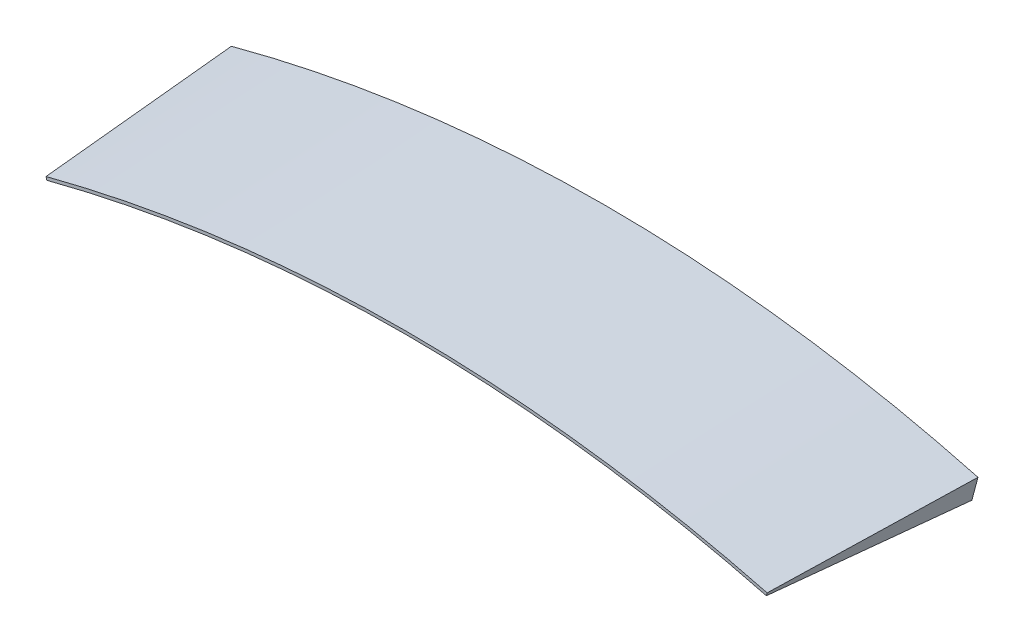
ISO-10303-21;
HEADER;
FILE_DESCRIPTION(('STEP AP214'),'2;1');
FILE_NAME('part.step','',(''),(''),'','','');
FILE_SCHEMA(('AUTOMOTIVE_DESIGN { 1 0 10303 214 1 1 1 1 }'));
ENDSEC;
DATA;
#1=APPLICATION_CONTEXT('core data for automotive mechanical design processes');
#2=APPLICATION_PROTOCOL_DEFINITION('international standard','automotive_design',2000,#1);
#3=PRODUCT_CONTEXT('',#1,'mechanical');
#4=PRODUCT('Part','Part','',(#3));
#5=PRODUCT_RELATED_PRODUCT_CATEGORY('part','',(#4));
#6=PRODUCT_DEFINITION_FORMATION('','',#4);
#7=PRODUCT_DEFINITION_CONTEXT('part definition',#1,'design');
#8=PRODUCT_DEFINITION('design','',#6,#7);
#9=PRODUCT_DEFINITION_SHAPE('','',#8);
#10=(LENGTH_UNIT() NAMED_UNIT(*) SI_UNIT(.MILLI.,.METRE.));
#11=(NAMED_UNIT(*) PLANE_ANGLE_UNIT() SI_UNIT($,.RADIAN.));
#12=(NAMED_UNIT(*) SI_UNIT($,.STERADIAN.) SOLID_ANGLE_UNIT());
#13=UNCERTAINTY_MEASURE_WITH_UNIT(LENGTH_MEASURE(1.E-05),#10,'distance_accuracy_value','');
#14=(GEOMETRIC_REPRESENTATION_CONTEXT(3) GLOBAL_UNCERTAINTY_ASSIGNED_CONTEXT((#13)) GLOBAL_UNIT_ASSIGNED_CONTEXT((#10,
#11,#12)) REPRESENTATION_CONTEXT('',''));
#15=CARTESIAN_POINT('',(0.,0.,0.));
#16=DIRECTION('',(0.,0.,1.));
#17=DIRECTION('',(1.,0.,0.));
#18=AXIS2_PLACEMENT_3D('',#15,#16,#17);
#19=CARTESIAN_POINT('',(0.,0.,0.));
#20=DIRECTION('',(0.,0.,1.));
#21=DIRECTION('',(1.,0.,0.));
#22=AXIS2_PLACEMENT_3D('',#19,#20,#21);
#23=CONICAL_SURFACE('',#22,179.,0.05235987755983);
#24=CARTESIAN_POINT('',(0.,0.,0.));
#25=DIRECTION('',(0.,0.,1.));
#26=DIRECTION('',(1.,0.,0.));
#27=AXIS2_PLACEMENT_3D('',#24,#25,#26);
#28=CIRCLE('',#27,179.);
#29=CARTESIAN_POINT('',(-46.3286090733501,172.900722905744,0.));
#30=VERTEX_POINT('',#29);
#31=CARTESIAN_POINT('',(46.3286090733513,172.900722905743,0.));
#32=VERTEX_POINT('',#31);
#33=EDGE_CURVE('E86',#30,#32,#28,.F.);
#34=ORIENTED_EDGE('',*,*,#33,.T.);
#35=CARTESIAN_POINT('',(45.400929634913,174.500778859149,25.));
#36=CARTESIAN_POINT('',(45.5557489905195,174.234863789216,20.8332922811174));
#37=CARTESIAN_POINT('',(45.71046528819,173.968568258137,16.6666050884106));
#38=CARTESIAN_POINT('',(46.0196917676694,173.435216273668,8.33327175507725));
#39=CARTESIAN_POINT('',(46.1742019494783,173.168159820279,4.16662561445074));
#40=CARTESIAN_POINT('',(46.3286090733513,172.900722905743,0.));
#41=B_SPLINE_CURVE_WITH_KNOTS('',3,(#35,#36,#37,#38,#39,#40),.UNSPECIFIED.,.F.,.F.,(4,2,4),(0.,
12.534161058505,25.0683221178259),.UNSPECIFIED.);
#42=CARTESIAN_POINT('',(45.400929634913,174.500778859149,25.));
#43=VERTEX_POINT('',#42);
#44=EDGE_CURVE('E11',#43,#32,#41,.T.);
#45=ORIENTED_EDGE('',*,*,#44,.F.);
#46=CARTESIAN_POINT('',(0.,0.,25.));
#47=DIRECTION('',(0.,0.,1.));
#48=DIRECTION('',(1.,0.,0.));
#49=AXIS2_PLACEMENT_3D('',#46,#47,#48);
#50=CIRCLE('',#49,180.310194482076);
#51=CARTESIAN_POINT('',(-45.4009296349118,174.50077885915,25.));
#52=VERTEX_POINT('',#51);
#53=EDGE_CURVE('E96',#52,#43,#50,.F.);
#54=ORIENTED_EDGE('',*,*,#53,.F.);
#55=CARTESIAN_POINT('',(-45.4009296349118,174.50077885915,25.));
#56=CARTESIAN_POINT('',(-45.5557489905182,174.234863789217,20.8332922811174));
#57=CARTESIAN_POINT('',(-45.7104652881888,173.968568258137,16.6666050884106));
#58=CARTESIAN_POINT('',(-46.0196917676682,173.435216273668,8.33327175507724));
#59=CARTESIAN_POINT('',(-46.1742019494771,173.168159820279,4.16662561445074));
#60=CARTESIAN_POINT('',(-46.3286090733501,172.900722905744,0.));
#61=B_SPLINE_CURVE_WITH_KNOTS('',3,(#55,#56,#57,#58,#59,#60),.UNSPECIFIED.,.F.,.F.,(4,2,4),(0.,
12.534161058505,25.0683221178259),.UNSPECIFIED.);
#62=EDGE_CURVE('E49',#52,#30,#61,.T.);
#63=ORIENTED_EDGE('',*,*,#62,.T.);
#64=EDGE_LOOP('',(#34,#45,#54,#63));
#65=FACE_BOUND('',#64,.T.);
#66=ADVANCED_FACE('F31',(#65),#23,.F.);
#67=CARTESIAN_POINT('',(47.1050662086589,175.79850038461,0.));
#68=DIRECTION('',(0.964602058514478,-0.258464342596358,0.0523359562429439));
#69=DIRECTION('',(0.258819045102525,0.965925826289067,0.));
#70=AXIS2_PLACEMENT_3D('',#67,#68,#69);
#71=PLANE('',#70);
#72=DIRECTION('',(-0.258819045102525,-0.965925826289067,0.));
#73=VECTOR('',#72,1.);
#74=CARTESIAN_POINT('',(47.1050662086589,175.79850038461,0.));
#75=LINE('',#74,#73);
#76=CARTESIAN_POINT('',(47.1050662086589,175.79850038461,0.));
#77=VERTEX_POINT('',#76);
#78=EDGE_CURVE('E80',#77,#32,#75,.T.);
#79=ORIENTED_EDGE('',*,*,#78,.F.);
#80=CARTESIAN_POINT('',(45.4991827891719,174.867464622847,25.));
#81=CARTESIAN_POINT('',(45.7670330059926,175.023403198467,20.8333748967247));
#82=CARTESIAN_POINT('',(46.034781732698,175.17895879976,16.6667290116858));
#83=CARTESIAN_POINT('',(46.5700762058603,175.489304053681,8.33339567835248));
#84=CARTESIAN_POINT('',(46.8376219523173,175.64409370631,4.166708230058));
#85=CARTESIAN_POINT('',(47.1050662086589,175.79850038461,0.));
#86=B_SPLINE_CURVE_WITH_KNOTS('',3,(#80,#81,#82,#83,#84,#85),.UNSPECIFIED.,.F.,.F.,(4,2,4),(0.,
12.5344095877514,25.0688191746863),.UNSPECIFIED.);
#87=CARTESIAN_POINT('',(45.4991827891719,174.867464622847,25.));
#88=VERTEX_POINT('',#87);
#89=EDGE_CURVE('E41',#88,#77,#86,.T.);
#90=ORIENTED_EDGE('',*,*,#89,.F.);
#91=DIRECTION('',(-0.258819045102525,-0.965925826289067,0.));
#92=VECTOR('',#91,1.);
#93=CARTESIAN_POINT('',(45.8395155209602,176.13760366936,25.));
#94=LINE('',#93,#92);
#95=EDGE_CURVE('E83',#88,#43,#94,.T.);
#96=ORIENTED_EDGE('',*,*,#95,.T.);
#97=ORIENTED_EDGE('',*,*,#44,.T.);
#98=EDGE_LOOP('',(#79,#90,#96,#97));
#99=FACE_BOUND('',#98,.T.);
#100=ADVANCED_FACE('F78',(#99),#71,.T.);
#101=CARTESIAN_POINT('',(0.,0.,0.));
#102=DIRECTION('',(0.,0.,-1.));
#103=DIRECTION('',(-1.,0.,0.));
#104=AXIS2_PLACEMENT_3D('',#101,#102,#103);
#105=CONICAL_SURFACE('',#104,182.,0.05235987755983);
#106=CARTESIAN_POINT('',(0.,0.,0.));
#107=DIRECTION('',(0.,0.,-1.));
#108=DIRECTION('',(-1.,0.,0.));
#109=AXIS2_PLACEMENT_3D('',#106,#107,#108);
#110=CIRCLE('',#109,182.);
#111=CARTESIAN_POINT('',(-47.1050662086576,175.798500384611,0.));
#112=VERTEX_POINT('',#111);
#113=EDGE_CURVE('E91',#112,#77,#110,.T.);
#114=ORIENTED_EDGE('',*,*,#113,.F.);
#115=CARTESIAN_POINT('',(-45.4991827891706,174.867464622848,25.));
#116=CARTESIAN_POINT('',(-45.7670330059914,175.023403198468,20.8333748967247));
#117=CARTESIAN_POINT('',(-46.0347817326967,175.178958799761,16.6667290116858));
#118=CARTESIAN_POINT('',(-46.570076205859,175.489304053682,8.33339567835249));
#119=CARTESIAN_POINT('',(-46.837621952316,175.64409370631,4.16670823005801));
#120=CARTESIAN_POINT('',(-47.1050662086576,175.798500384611,0.));
#121=B_SPLINE_CURVE_WITH_KNOTS('',3,(#115,#116,#117,#118,#119,#120),.UNSPECIFIED.,.F.,.F.,(4,2,
4),(0.,12.5344095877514,25.0688191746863),.UNSPECIFIED.);
#122=CARTESIAN_POINT('',(-45.4991827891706,174.867464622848,25.));
#123=VERTEX_POINT('',#122);
#124=EDGE_CURVE('E57',#123,#112,#121,.T.);
#125=ORIENTED_EDGE('',*,*,#124,.F.);
#126=CARTESIAN_POINT('',(0.,0.,25.));
#127=DIRECTION('',(0.,0.,1.));
#128=DIRECTION('',(1.,0.,0.));
#129=AXIS2_PLACEMENT_3D('',#126,#127,#128);
#130=CIRCLE('',#129,180.689805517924);
#131=EDGE_CURVE('E123',#123,#88,#130,.F.);
#132=ORIENTED_EDGE('',*,*,#131,.T.);
#133=ORIENTED_EDGE('',*,*,#89,.T.);
#134=EDGE_LOOP('',(#114,#125,#132,#133));
#135=FACE_BOUND('',#134,.T.);
#136=ADVANCED_FACE('F33',(#135),#105,.T.);
#137=CARTESIAN_POINT('',(-46.3286090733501,172.900722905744,0.));
#138=DIRECTION('',(-0.964602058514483,-0.258464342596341,0.0523359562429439));
#139=DIRECTION('',(0.258819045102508,-0.965925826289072,0.));
#140=AXIS2_PLACEMENT_3D('',#137,#138,#139);
#141=PLANE('',#140);
#142=DIRECTION('',(-0.258819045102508,0.965925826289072,0.));
#143=VECTOR('',#142,1.);
#144=CARTESIAN_POINT('',(-46.3286090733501,172.900722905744,0.));
#145=LINE('',#144,#143);
#146=EDGE_CURVE('E93',#30,#112,#145,.T.);
#147=ORIENTED_EDGE('',*,*,#146,.F.);
#148=ORIENTED_EDGE('',*,*,#62,.F.);
#149=DIRECTION('',(-0.258819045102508,0.965925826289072,0.));
#150=VECTOR('',#149,1.);
#151=CARTESIAN_POINT('',(-45.0630583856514,173.239826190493,25.));
#152=LINE('',#151,#150);
#153=EDGE_CURVE('E36',#52,#123,#152,.T.);
#154=ORIENTED_EDGE('',*,*,#153,.T.);
#155=ORIENTED_EDGE('',*,*,#124,.T.);
#156=EDGE_LOOP('',(#147,#148,#154,#155));
#157=FACE_BOUND('',#156,.T.);
#158=ADVANCED_FACE('F111',(#157),#141,.T.);
#159=CARTESIAN_POINT('',(0.,0.,25.));
#160=DIRECTION('',(0.,0.,1.));
#161=DIRECTION('',(1.,0.,0.));
#162=AXIS2_PLACEMENT_3D('',#159,#160,#161);
#163=PLANE('',#162);
#164=ORIENTED_EDGE('',*,*,#53,.T.);
#165=ORIENTED_EDGE('',*,*,#95,.F.);
#166=ORIENTED_EDGE('',*,*,#131,.F.);
#167=ORIENTED_EDGE('',*,*,#153,.F.);
#168=EDGE_LOOP('',(#164,#165,#166,#167));
#169=FACE_BOUND('',#168,.T.);
#170=ADVANCED_FACE('F126',(#169),#163,.T.);
#171=CARTESIAN_POINT('',(0.,0.,0.));
#172=DIRECTION('',(0.,0.,1.));
#173=DIRECTION('',(1.,0.,0.));
#174=AXIS2_PLACEMENT_3D('',#171,#172,#173);
#175=PLANE('',#174);
#176=ORIENTED_EDGE('',*,*,#33,.F.);
#177=ORIENTED_EDGE('',*,*,#146,.T.);
#178=ORIENTED_EDGE('',*,*,#113,.T.);
#179=ORIENTED_EDGE('',*,*,#78,.T.);
#180=EDGE_LOOP('',(#176,#177,#178,#179));
#181=FACE_BOUND('',#180,.T.);
#182=ADVANCED_FACE('F90',(#181),#175,.F.);
#183=CLOSED_SHELL('',(#66,#100,#136,#158,#170,#182));
#184=MANIFOLD_SOLID_BREP('B2',#183);
#185=ADVANCED_BREP_SHAPE_REPRESENTATION('',(#18,#184),#14);
#186=SHAPE_DEFINITION_REPRESENTATION(#9,#185);
ENDSEC;
END-ISO-10303-21;
